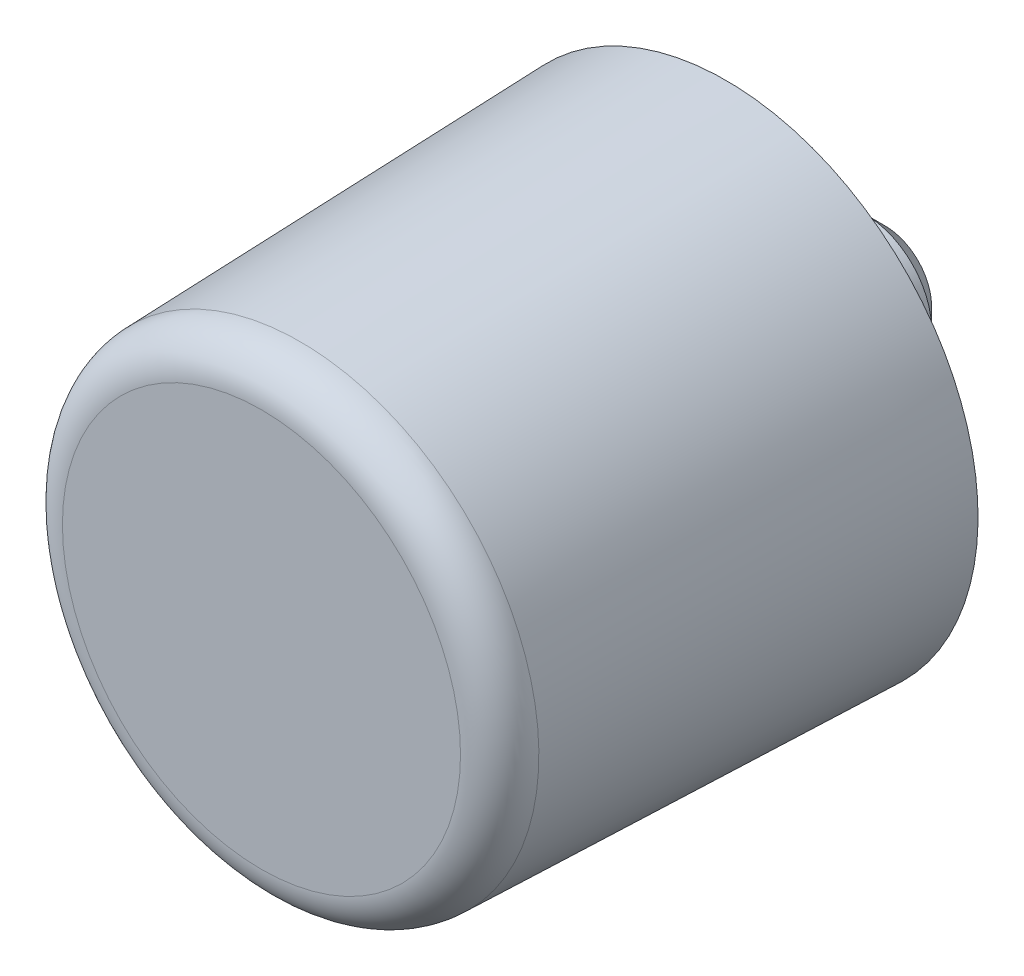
ISO-10303-21;
HEADER;
FILE_DESCRIPTION(('STEP AP214'),'2;1');
FILE_NAME('part.step','',(''),(''),'','','');
FILE_SCHEMA(('AUTOMOTIVE_DESIGN { 1 0 10303 214 1 1 1 1 }'));
ENDSEC;
DATA;
#1=APPLICATION_CONTEXT('core data for automotive mechanical design processes');
#2=APPLICATION_PROTOCOL_DEFINITION('international standard','automotive_design',2000,#1);
#3=PRODUCT_CONTEXT('',#1,'mechanical');
#4=PRODUCT('Part','Part','',(#3));
#5=PRODUCT_RELATED_PRODUCT_CATEGORY('part','',(#4));
#6=PRODUCT_DEFINITION_FORMATION('','',#4);
#7=PRODUCT_DEFINITION_CONTEXT('part definition',#1,'design');
#8=PRODUCT_DEFINITION('design','',#6,#7);
#9=PRODUCT_DEFINITION_SHAPE('','',#8);
#10=(LENGTH_UNIT() NAMED_UNIT(*) SI_UNIT(.MILLI.,.METRE.));
#11=(NAMED_UNIT(*) PLANE_ANGLE_UNIT() SI_UNIT($,.RADIAN.));
#12=(NAMED_UNIT(*) SI_UNIT($,.STERADIAN.) SOLID_ANGLE_UNIT());
#13=UNCERTAINTY_MEASURE_WITH_UNIT(LENGTH_MEASURE(1.E-05),#10,'distance_accuracy_value','');
#14=(GEOMETRIC_REPRESENTATION_CONTEXT(3) GLOBAL_UNCERTAINTY_ASSIGNED_CONTEXT((#13)) GLOBAL_UNIT_ASSIGNED_CONTEXT((#10,
#11,#12)) REPRESENTATION_CONTEXT('',''));
#15=CARTESIAN_POINT('',(0.,0.,0.));
#16=DIRECTION('',(0.,0.,1.));
#17=DIRECTION('',(1.,0.,0.));
#18=AXIS2_PLACEMENT_3D('',#15,#16,#17);
#19=CARTESIAN_POINT('',(0.,0.,35.));
#20=DIRECTION('',(0.,0.,1.));
#21=DIRECTION('',(0.,-1.,0.));
#22=AXIS2_PLACEMENT_3D('',#19,#20,#21);
#23=CYLINDRICAL_SURFACE('',#22,17.1);
#24=CARTESIAN_POINT('',(0.,0.,0.));
#25=DIRECTION('',(0.,0.,1.));
#26=DIRECTION('',(0.,-1.,0.));
#27=AXIS2_PLACEMENT_3D('',#24,#25,#26);
#28=CIRCLE('',#27,17.1);
#29=CARTESIAN_POINT('',(0.,-17.1,0.));
#30=VERTEX_POINT('',#29);
#31=EDGE_CURVE('E27',#30,#30,#28,.T.);
#32=ORIENTED_EDGE('',*,*,#31,.F.);
#33=EDGE_LOOP('',(#32));
#34=FACE_BOUND('',#33,.T.);
#35=CARTESIAN_POINT('',(0.,0.,0.0500000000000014));
#36=DIRECTION('',(0.,0.,1.));
#37=DIRECTION('',(0.,-1.,0.));
#38=AXIS2_PLACEMENT_3D('',#35,#36,#37);
#39=CIRCLE('',#38,17.1);
#40=CARTESIAN_POINT('',(0.,-17.1,0.0500000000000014));
#41=VERTEX_POINT('',#40);
#42=EDGE_CURVE('E44',#41,#41,#39,.T.);
#43=ORIENTED_EDGE('',*,*,#42,.T.);
#44=EDGE_LOOP('',(#43));
#45=FACE_BOUND('',#44,.T.);
#46=ADVANCED_FACE('F12',(#34,#45),#23,.F.);
#47=CARTESIAN_POINT('',(17.1,0.,0.));
#48=DIRECTION('',(0.,0.,1.));
#49=DIRECTION('',(0.,-1.,0.));
#50=AXIS2_PLACEMENT_3D('',#47,#48,#49);
#51=PLANE('',#50);
#52=CARTESIAN_POINT('',(0.,0.,0.));
#53=DIRECTION('',(0.,0.,1.));
#54=DIRECTION('',(0.,-1.,0.));
#55=AXIS2_PLACEMENT_3D('',#52,#53,#54);
#56=CIRCLE('',#55,19.);
#57=CARTESIAN_POINT('',(0.,-19.,0.));
#58=VERTEX_POINT('',#57);
#59=EDGE_CURVE('E32',#58,#58,#56,.T.);
#60=ORIENTED_EDGE('',*,*,#59,.F.);
#61=EDGE_LOOP('',(#60));
#62=FACE_BOUND('',#61,.T.);
#63=ORIENTED_EDGE('',*,*,#31,.T.);
#64=EDGE_LOOP('',(#63));
#65=FACE_BOUND('',#64,.T.);
#66=ADVANCED_FACE('F72',(#62,#65),#51,.F.);
#67=CARTESIAN_POINT('',(0.,0.,0.));
#68=DIRECTION('',(0.,0.,-1.));
#69=DIRECTION('',(0.,1.,0.));
#70=AXIS2_PLACEMENT_3D('',#67,#68,#69);
#71=CONICAL_SURFACE('',#70,19.,0.0311942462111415);
#72=CARTESIAN_POINT('',(0.,0.,32.0935675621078));
#73=DIRECTION('',(0.,0.,1.));
#74=DIRECTION('',(0.,-1.,0.));
#75=AXIS2_PLACEMENT_3D('',#72,#73,#74);
#76=CIRCLE('',#75,17.9985404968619);
#77=CARTESIAN_POINT('',(0.,-17.9985404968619,32.0935675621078));
#78=VERTEX_POINT('',#77);
#79=EDGE_CURVE('E35',#78,#78,#76,.T.);
#80=ORIENTED_EDGE('',*,*,#79,.F.);
#81=EDGE_LOOP('',(#80));
#82=FACE_BOUND('',#81,.T.);
#83=ORIENTED_EDGE('',*,*,#59,.T.);
#84=EDGE_LOOP('',(#83));
#85=FACE_BOUND('',#84,.T.);
#86=ADVANCED_FACE('F77',(#82,#85),#71,.T.);
#87=CARTESIAN_POINT('',(0.,0.,32.));
#88=DIRECTION('',(0.,0.,1.));
#89=DIRECTION('',(0.,-1.,0.));
#90=AXIS2_PLACEMENT_3D('',#87,#88,#89);
#91=TOROIDAL_SURFACE('',#90,15.,3.);
#92=ORIENTED_EDGE('',*,*,#79,.T.);
#93=EDGE_LOOP('',(#92));
#94=FACE_BOUND('',#93,.T.);
#95=CARTESIAN_POINT('',(0.,0.,35.));
#96=DIRECTION('',(0.,0.,1.));
#97=DIRECTION('',(0.,-1.,0.));
#98=AXIS2_PLACEMENT_3D('',#95,#96,#97);
#99=CIRCLE('',#98,15.);
#100=CARTESIAN_POINT('',(0.,-15.,35.));
#101=VERTEX_POINT('',#100);
#102=EDGE_CURVE('E38',#101,#101,#99,.T.);
#103=ORIENTED_EDGE('',*,*,#102,.F.);
#104=EDGE_LOOP('',(#103));
#105=FACE_BOUND('',#104,.T.);
#106=ADVANCED_FACE('F84',(#94,#105),#91,.T.);
#107=CARTESIAN_POINT('',(15.,0.,35.));
#108=DIRECTION('',(0.,0.,-1.));
#109=DIRECTION('',(0.,1.,0.));
#110=AXIS2_PLACEMENT_3D('',#107,#108,#109);
#111=PLANE('',#110);
#112=ORIENTED_EDGE('',*,*,#102,.T.);
#113=EDGE_LOOP('',(#112));
#114=FACE_BOUND('',#113,.T.);
#115=ADVANCED_FACE('F59',(#114),#111,.F.);
#116=CARTESIAN_POINT('',(0.,0.,0.));
#117=DIRECTION('',(0.,0.,1.));
#118=DIRECTION('',(0.,-1.,0.));
#119=AXIS2_PLACEMENT_3D('',#116,#117,#118);
#120=PLANE('',#119);
#121=CARTESIAN_POINT('',(0.,0.,0.));
#122=DIRECTION('',(0.,0.,1.));
#123=DIRECTION('',(0.,-1.,0.));
#124=AXIS2_PLACEMENT_3D('',#121,#122,#123);
#125=CIRCLE('',#124,17.05);
#126=CARTESIAN_POINT('',(0.,-17.05,0.));
#127=VERTEX_POINT('',#126);
#128=EDGE_CURVE('E41',#127,#127,#125,.T.);
#129=ORIENTED_EDGE('',*,*,#128,.F.);
#130=EDGE_LOOP('',(#129));
#131=FACE_BOUND('',#130,.T.);
#132=CARTESIAN_POINT('',(0.,0.,0.));
#133=DIRECTION('',(0.,0.,1.));
#134=DIRECTION('',(0.,-1.,0.));
#135=AXIS2_PLACEMENT_3D('',#132,#133,#134);
#136=CIRCLE('',#135,5.);
#137=CARTESIAN_POINT('',(0.,-5.,0.));
#138=VERTEX_POINT('',#137);
#139=EDGE_CURVE('E23',#138,#138,#136,.T.);
#140=ORIENTED_EDGE('',*,*,#139,.T.);
#141=EDGE_LOOP('',(#140));
#142=FACE_BOUND('',#141,.T.);
#143=ADVANCED_FACE('F53',(#131,#142),#120,.F.);
#144=CARTESIAN_POINT('',(0.,0.,0.));
#145=DIRECTION('',(0.,0.,1.));
#146=DIRECTION('',(0.,-1.,0.));
#147=AXIS2_PLACEMENT_3D('',#144,#145,#146);
#148=CONICAL_SURFACE('',#147,17.05,0.785398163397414);
#149=ORIENTED_EDGE('',*,*,#42,.F.);
#150=EDGE_LOOP('',(#149));
#151=FACE_BOUND('',#150,.T.);
#152=ORIENTED_EDGE('',*,*,#128,.T.);
#153=EDGE_LOOP('',(#152));
#154=FACE_BOUND('',#153,.T.);
#155=ADVANCED_FACE('F49',(#151,#154),#148,.T.);
#156=CARTESIAN_POINT('',(0.,0.,35.));
#157=DIRECTION('',(0.,0.,1.));
#158=DIRECTION('',(0.,-1.,0.));
#159=AXIS2_PLACEMENT_3D('',#156,#157,#158);
#160=CYLINDRICAL_SURFACE('',#159,5.);
#161=CARTESIAN_POINT('',(0.,0.,-10.5));
#162=DIRECTION('',(0.,0.,1.));
#163=DIRECTION('',(0.,-1.,0.));
#164=AXIS2_PLACEMENT_3D('',#161,#162,#163);
#165=CIRCLE('',#164,5.);
#166=CARTESIAN_POINT('',(0.,-5.,-10.5));
#167=VERTEX_POINT('',#166);
#168=EDGE_CURVE('E8',#167,#167,#165,.T.);
#169=ORIENTED_EDGE('',*,*,#168,.T.);
#170=EDGE_LOOP('',(#169));
#171=FACE_BOUND('',#170,.T.);
#172=ORIENTED_EDGE('',*,*,#139,.F.);
#173=EDGE_LOOP('',(#172));
#174=FACE_BOUND('',#173,.T.);
#175=ADVANCED_FACE('F52',(#171,#174),#160,.T.);
#176=CARTESIAN_POINT('',(0.,0.,-12.));
#177=DIRECTION('',(0.,0.,1.));
#178=DIRECTION('',(0.,-1.,0.));
#179=AXIS2_PLACEMENT_3D('',#176,#177,#178);
#180=PLANE('',#179);
#181=CARTESIAN_POINT('',(0.,0.,-12.));
#182=DIRECTION('',(0.,0.,1.));
#183=DIRECTION('',(0.,-1.,0.));
#184=AXIS2_PLACEMENT_3D('',#181,#182,#183);
#185=CIRCLE('',#184,3.5);
#186=CARTESIAN_POINT('',(0.,-3.5,-12.));
#187=VERTEX_POINT('',#186);
#188=EDGE_CURVE('E19',#187,#187,#185,.F.);
#189=ORIENTED_EDGE('',*,*,#188,.T.);
#190=EDGE_LOOP('',(#189));
#191=FACE_BOUND('',#190,.T.);
#192=ADVANCED_FACE('F64',(#191),#180,.F.);
#193=CARTESIAN_POINT('',(0.,0.,-12.));
#194=DIRECTION('',(0.,0.,1.));
#195=DIRECTION('',(0.,-1.,0.));
#196=AXIS2_PLACEMENT_3D('',#193,#194,#195);
#197=CONICAL_SURFACE('',#196,3.5,0.785398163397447);
#198=ORIENTED_EDGE('',*,*,#168,.F.);
#199=EDGE_LOOP('',(#198));
#200=FACE_BOUND('',#199,.T.);
#201=ORIENTED_EDGE('',*,*,#188,.F.);
#202=EDGE_LOOP('',(#201));
#203=FACE_BOUND('',#202,.T.);
#204=ADVANCED_FACE('F14',(#200,#203),#197,.T.);
#205=CLOSED_SHELL('',(#46,#66,#86,#106,#115,#143,#155,#175,#192,#204));
#206=MANIFOLD_SOLID_BREP('B1',#205);
#207=ADVANCED_BREP_SHAPE_REPRESENTATION('',(#18,#206),#14);
#208=SHAPE_DEFINITION_REPRESENTATION(#9,#207);
ENDSEC;
END-ISO-10303-21;
